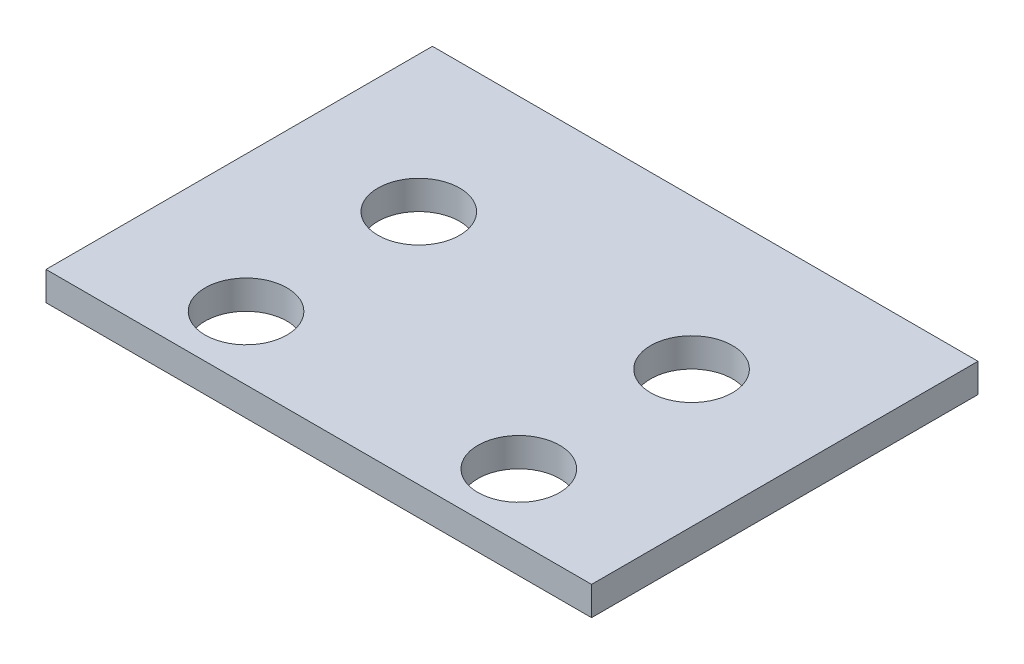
ISO-10303-21;
HEADER;
FILE_DESCRIPTION(('STEP AP214'),'2;1');
FILE_NAME('part.step','',(''),(''),'','','');
FILE_SCHEMA(('AUTOMOTIVE_DESIGN { 1 0 10303 214 1 1 1 1 }'));
ENDSEC;
DATA;
#1=APPLICATION_CONTEXT('core data for automotive mechanical design processes');
#2=APPLICATION_PROTOCOL_DEFINITION('international standard','automotive_design',2000,#1);
#3=PRODUCT_CONTEXT('',#1,'mechanical');
#4=PRODUCT('Part','Part','',(#3));
#5=PRODUCT_RELATED_PRODUCT_CATEGORY('part','',(#4));
#6=PRODUCT_DEFINITION_FORMATION('','',#4);
#7=PRODUCT_DEFINITION_CONTEXT('part definition',#1,'design');
#8=PRODUCT_DEFINITION('design','',#6,#7);
#9=PRODUCT_DEFINITION_SHAPE('','',#8);
#10=(LENGTH_UNIT() NAMED_UNIT(*) SI_UNIT(.MILLI.,.METRE.));
#11=(NAMED_UNIT(*) PLANE_ANGLE_UNIT() SI_UNIT($,.RADIAN.));
#12=(NAMED_UNIT(*) SI_UNIT($,.STERADIAN.) SOLID_ANGLE_UNIT());
#13=UNCERTAINTY_MEASURE_WITH_UNIT(LENGTH_MEASURE(1.E-05),#10,'distance_accuracy_value','');
#14=(GEOMETRIC_REPRESENTATION_CONTEXT(3) GLOBAL_UNCERTAINTY_ASSIGNED_CONTEXT((#13)) GLOBAL_UNIT_ASSIGNED_CONTEXT((#10,
#11,#12)) REPRESENTATION_CONTEXT('',''));
#15=CARTESIAN_POINT('',(0.,0.,0.));
#16=DIRECTION('',(0.,0.,1.));
#17=DIRECTION('',(1.,0.,0.));
#18=AXIS2_PLACEMENT_3D('',#15,#16,#17);
#19=CARTESIAN_POINT('',(30.,3.175,-21.25));
#20=DIRECTION('',(-1.,0.,0.));
#21=DIRECTION('',(0.,0.,1.));
#22=AXIS2_PLACEMENT_3D('',#19,#20,#21);
#23=PLANE('',#22);
#24=DIRECTION('',(0.,0.,-1.));
#25=VECTOR('',#24,1.);
#26=CARTESIAN_POINT('',(30.,0.,-21.25));
#27=LINE('',#26,#25);
#28=CARTESIAN_POINT('',(30.,0.,21.25));
#29=VERTEX_POINT('',#28);
#30=CARTESIAN_POINT('',(30.,0.,-21.25));
#31=VERTEX_POINT('',#30);
#32=EDGE_CURVE('E98',#29,#31,#27,.T.);
#33=ORIENTED_EDGE('',*,*,#32,.T.);
#34=DIRECTION('',(0.,-1.,0.));
#35=VECTOR('',#34,1.);
#36=CARTESIAN_POINT('',(30.,3.175,-21.25));
#37=LINE('',#36,#35);
#38=CARTESIAN_POINT('',(30.,3.175,-21.25));
#39=VERTEX_POINT('',#38);
#40=EDGE_CURVE('E11',#39,#31,#37,.T.);
#41=ORIENTED_EDGE('',*,*,#40,.F.);
#42=DIRECTION('',(0.,0.,-1.));
#43=VECTOR('',#42,1.);
#44=CARTESIAN_POINT('',(30.,3.175,-21.25));
#45=LINE('',#44,#43);
#46=CARTESIAN_POINT('',(30.,3.175,21.25));
#47=VERTEX_POINT('',#46);
#48=EDGE_CURVE('E85',#47,#39,#45,.T.);
#49=ORIENTED_EDGE('',*,*,#48,.F.);
#50=DIRECTION('',(0.,-1.,0.));
#51=VECTOR('',#50,1.);
#52=CARTESIAN_POINT('',(30.,3.175,21.25));
#53=LINE('',#52,#51);
#54=EDGE_CURVE('E94',#47,#29,#53,.T.);
#55=ORIENTED_EDGE('',*,*,#54,.T.);
#56=EDGE_LOOP('',(#33,#41,#49,#55));
#57=FACE_BOUND('',#56,.T.);
#58=ADVANCED_FACE('F32',(#57),#23,.F.);
#59=CARTESIAN_POINT('',(-30.,3.175,-21.25));
#60=DIRECTION('',(0.,0.,1.));
#61=DIRECTION('',(1.,0.,0.));
#62=AXIS2_PLACEMENT_3D('',#59,#60,#61);
#63=PLANE('',#62);
#64=DIRECTION('',(-1.,0.,0.));
#65=VECTOR('',#64,1.);
#66=CARTESIAN_POINT('',(-30.,0.,-21.25));
#67=LINE('',#66,#65);
#68=CARTESIAN_POINT('',(-30.,0.,-21.25));
#69=VERTEX_POINT('',#68);
#70=EDGE_CURVE('E89',#31,#69,#67,.T.);
#71=ORIENTED_EDGE('',*,*,#70,.T.);
#72=DIRECTION('',(0.,-1.,0.));
#73=VECTOR('',#72,1.);
#74=CARTESIAN_POINT('',(-30.,3.175,-21.25));
#75=LINE('',#74,#73);
#76=CARTESIAN_POINT('',(-30.,3.175,-21.25));
#77=VERTEX_POINT('',#76);
#78=EDGE_CURVE('E41',#77,#69,#75,.T.);
#79=ORIENTED_EDGE('',*,*,#78,.F.);
#80=DIRECTION('',(-1.,0.,0.));
#81=VECTOR('',#80,1.);
#82=CARTESIAN_POINT('',(-30.,3.175,-21.25));
#83=LINE('',#82,#81);
#84=EDGE_CURVE('E80',#39,#77,#83,.T.);
#85=ORIENTED_EDGE('',*,*,#84,.F.);
#86=ORIENTED_EDGE('',*,*,#40,.T.);
#87=EDGE_LOOP('',(#71,#79,#85,#86));
#88=FACE_BOUND('',#87,.T.);
#89=ADVANCED_FACE('F88',(#88),#63,.F.);
#90=CARTESIAN_POINT('',(-30.,3.175,-21.25));
#91=DIRECTION('',(1.,0.,0.));
#92=DIRECTION('',(0.,0.,-1.));
#93=AXIS2_PLACEMENT_3D('',#90,#91,#92);
#94=PLANE('',#93);
#95=DIRECTION('',(0.,0.,1.));
#96=VECTOR('',#95,1.);
#97=CARTESIAN_POINT('',(-30.,0.,-21.25));
#98=LINE('',#97,#96);
#99=CARTESIAN_POINT('',(-30.,0.,21.25));
#100=VERTEX_POINT('',#99);
#101=EDGE_CURVE('E67',#69,#100,#98,.T.);
#102=ORIENTED_EDGE('',*,*,#101,.T.);
#103=DIRECTION('',(0.,-1.,0.));
#104=VECTOR('',#103,1.);
#105=CARTESIAN_POINT('',(-30.,3.175,21.25));
#106=LINE('',#105,#104);
#107=CARTESIAN_POINT('',(-30.,3.175,21.25));
#108=VERTEX_POINT('',#107);
#109=EDGE_CURVE('E90',#108,#100,#106,.T.);
#110=ORIENTED_EDGE('',*,*,#109,.F.);
#111=DIRECTION('',(0.,0.,1.));
#112=VECTOR('',#111,1.);
#113=CARTESIAN_POINT('',(-30.,3.175,-21.25));
#114=LINE('',#113,#112);
#115=EDGE_CURVE('E83',#77,#108,#114,.T.);
#116=ORIENTED_EDGE('',*,*,#115,.F.);
#117=ORIENTED_EDGE('',*,*,#78,.T.);
#118=EDGE_LOOP('',(#102,#110,#116,#117));
#119=FACE_BOUND('',#118,.T.);
#120=ADVANCED_FACE('F92',(#119),#94,.F.);
#121=CARTESIAN_POINT('',(-30.,3.175,21.25));
#122=DIRECTION('',(0.,0.,-1.));
#123=DIRECTION('',(-1.,0.,0.));
#124=AXIS2_PLACEMENT_3D('',#121,#122,#123);
#125=PLANE('',#124);
#126=DIRECTION('',(1.,0.,0.));
#127=VECTOR('',#126,1.);
#128=CARTESIAN_POINT('',(-30.,0.,21.25));
#129=LINE('',#128,#127);
#130=EDGE_CURVE('E73',#100,#29,#129,.T.);
#131=ORIENTED_EDGE('',*,*,#130,.T.);
#132=ORIENTED_EDGE('',*,*,#54,.F.);
#133=DIRECTION('',(1.,0.,0.));
#134=VECTOR('',#133,1.);
#135=CARTESIAN_POINT('',(-30.,3.175,21.25));
#136=LINE('',#135,#134);
#137=EDGE_CURVE('E50',#108,#47,#136,.T.);
#138=ORIENTED_EDGE('',*,*,#137,.F.);
#139=ORIENTED_EDGE('',*,*,#109,.T.);
#140=EDGE_LOOP('',(#131,#132,#138,#139));
#141=FACE_BOUND('',#140,.T.);
#142=ADVANCED_FACE('F155',(#141),#125,.F.);
#143=CARTESIAN_POINT('',(30.,3.175,21.25));
#144=DIRECTION('',(0.,1.,0.));
#145=DIRECTION('',(0.,0.,1.));
#146=AXIS2_PLACEMENT_3D('',#143,#144,#145);
#147=PLANE('',#146);
#148=CARTESIAN_POINT('',(15.,3.175,-4.75000000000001));
#149=DIRECTION('',(0.,1.,0.));
#150=DIRECTION('',(0.,0.,1.));
#151=AXIS2_PLACEMENT_3D('',#148,#149,#150);
#152=CIRCLE('',#151,4.49999999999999);
#153=CARTESIAN_POINT('',(15.,3.175,-0.250000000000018));
#154=VERTEX_POINT('',#153);
#155=EDGE_CURVE('E123',#154,#154,#152,.T.);
#156=ORIENTED_EDGE('',*,*,#155,.F.);
#157=EDGE_LOOP('',(#156));
#158=FACE_BOUND('',#157,.T.);
#159=CARTESIAN_POINT('',(-15.,3.175,-4.75000000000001));
#160=DIRECTION('',(0.,1.,0.));
#161=DIRECTION('',(0.,0.,1.));
#162=AXIS2_PLACEMENT_3D('',#159,#160,#161);
#163=CIRCLE('',#162,4.49999999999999);
#164=CARTESIAN_POINT('',(-15.,3.175,-0.250000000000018));
#165=VERTEX_POINT('',#164);
#166=EDGE_CURVE('E113',#165,#165,#163,.T.);
#167=ORIENTED_EDGE('',*,*,#166,.F.);
#168=EDGE_LOOP('',(#167));
#169=FACE_BOUND('',#168,.T.);
#170=CARTESIAN_POINT('',(15.,3.175,14.25));
#171=DIRECTION('',(0.,1.,0.));
#172=DIRECTION('',(0.,0.,1.));
#173=AXIS2_PLACEMENT_3D('',#170,#171,#172);
#174=CIRCLE('',#173,4.49999999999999);
#175=CARTESIAN_POINT('',(15.,3.175,18.75));
#176=VERTEX_POINT('',#175);
#177=EDGE_CURVE('E110',#176,#176,#174,.T.);
#178=ORIENTED_EDGE('',*,*,#177,.F.);
#179=EDGE_LOOP('',(#178));
#180=FACE_BOUND('',#179,.T.);
#181=CARTESIAN_POINT('',(-15.,3.175,14.25));
#182=DIRECTION('',(0.,1.,0.));
#183=DIRECTION('',(0.,0.,1.));
#184=AXIS2_PLACEMENT_3D('',#181,#182,#183);
#185=CIRCLE('',#184,4.49999999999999);
#186=CARTESIAN_POINT('',(-15.,3.175,18.75));
#187=VERTEX_POINT('',#186);
#188=EDGE_CURVE('E109',#187,#187,#185,.T.);
#189=ORIENTED_EDGE('',*,*,#188,.F.);
#190=EDGE_LOOP('',(#189));
#191=FACE_BOUND('',#190,.T.);
#192=ORIENTED_EDGE('',*,*,#48,.T.);
#193=ORIENTED_EDGE('',*,*,#84,.T.);
#194=ORIENTED_EDGE('',*,*,#115,.T.);
#195=ORIENTED_EDGE('',*,*,#137,.T.);
#196=EDGE_LOOP('',(#192,#193,#194,#195));
#197=FACE_BOUND('',#196,.T.);
#198=ADVANCED_FACE('F81',(#158,#169,#180,#191,#197),#147,.T.);
#199=CARTESIAN_POINT('',(30.,0.,21.25));
#200=DIRECTION('',(0.,1.,0.));
#201=DIRECTION('',(0.,0.,1.));
#202=AXIS2_PLACEMENT_3D('',#199,#200,#201);
#203=PLANE('',#202);
#204=CARTESIAN_POINT('',(15.,0.,-4.75000000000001));
#205=DIRECTION('',(0.,1.,0.));
#206=DIRECTION('',(0.,0.,1.));
#207=AXIS2_PLACEMENT_3D('',#204,#205,#206);
#208=CIRCLE('',#207,4.49999999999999);
#209=CARTESIAN_POINT('',(15.,0.,-0.250000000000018));
#210=VERTEX_POINT('',#209);
#211=EDGE_CURVE('E35',#210,#210,#208,.T.);
#212=ORIENTED_EDGE('',*,*,#211,.T.);
#213=EDGE_LOOP('',(#212));
#214=FACE_BOUND('',#213,.T.);
#215=CARTESIAN_POINT('',(-15.,0.,-4.75000000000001));
#216=DIRECTION('',(0.,1.,0.));
#217=DIRECTION('',(0.,0.,1.));
#218=AXIS2_PLACEMENT_3D('',#215,#216,#217);
#219=CIRCLE('',#218,4.49999999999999);
#220=CARTESIAN_POINT('',(-15.,0.,-0.250000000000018));
#221=VERTEX_POINT('',#220);
#222=EDGE_CURVE('E111',#221,#221,#219,.T.);
#223=ORIENTED_EDGE('',*,*,#222,.T.);
#224=EDGE_LOOP('',(#223));
#225=FACE_BOUND('',#224,.T.);
#226=CARTESIAN_POINT('',(15.,0.,14.25));
#227=DIRECTION('',(0.,1.,0.));
#228=DIRECTION('',(0.,0.,1.));
#229=AXIS2_PLACEMENT_3D('',#226,#227,#228);
#230=CIRCLE('',#229,4.49999999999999);
#231=CARTESIAN_POINT('',(15.,0.,18.75));
#232=VERTEX_POINT('',#231);
#233=EDGE_CURVE('E107',#232,#232,#230,.T.);
#234=ORIENTED_EDGE('',*,*,#233,.T.);
#235=EDGE_LOOP('',(#234));
#236=FACE_BOUND('',#235,.T.);
#237=CARTESIAN_POINT('',(-15.,0.,14.25));
#238=DIRECTION('',(0.,1.,0.));
#239=DIRECTION('',(0.,0.,1.));
#240=AXIS2_PLACEMENT_3D('',#237,#238,#239);
#241=CIRCLE('',#240,4.49999999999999);
#242=CARTESIAN_POINT('',(-15.,0.,18.75));
#243=VERTEX_POINT('',#242);
#244=EDGE_CURVE('E101',#243,#243,#241,.T.);
#245=ORIENTED_EDGE('',*,*,#244,.T.);
#246=EDGE_LOOP('',(#245));
#247=FACE_BOUND('',#246,.T.);
#248=ORIENTED_EDGE('',*,*,#32,.F.);
#249=ORIENTED_EDGE('',*,*,#130,.F.);
#250=ORIENTED_EDGE('',*,*,#101,.F.);
#251=ORIENTED_EDGE('',*,*,#70,.F.);
#252=EDGE_LOOP('',(#248,#249,#250,#251));
#253=FACE_BOUND('',#252,.T.);
#254=ADVANCED_FACE('F131',(#214,#225,#236,#247,#253),#203,.F.);
#255=CARTESIAN_POINT('',(-15.,3.175,14.25));
#256=DIRECTION('',(0.,1.,0.));
#257=DIRECTION('',(0.,0.,1.));
#258=AXIS2_PLACEMENT_3D('',#255,#256,#257);
#259=CYLINDRICAL_SURFACE('',#258,4.49999999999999);
#260=ORIENTED_EDGE('',*,*,#188,.T.);
#261=EDGE_LOOP('',(#260));
#262=FACE_BOUND('',#261,.T.);
#263=ORIENTED_EDGE('',*,*,#244,.F.);
#264=EDGE_LOOP('',(#263));
#265=FACE_BOUND('',#264,.T.);
#266=ADVANCED_FACE('F134',(#262,#265),#259,.F.);
#267=CARTESIAN_POINT('',(15.,3.175,14.25));
#268=DIRECTION('',(0.,1.,0.));
#269=DIRECTION('',(0.,0.,1.));
#270=AXIS2_PLACEMENT_3D('',#267,#268,#269);
#271=CYLINDRICAL_SURFACE('',#270,4.49999999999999);
#272=ORIENTED_EDGE('',*,*,#177,.T.);
#273=EDGE_LOOP('',(#272));
#274=FACE_BOUND('',#273,.T.);
#275=ORIENTED_EDGE('',*,*,#233,.F.);
#276=EDGE_LOOP('',(#275));
#277=FACE_BOUND('',#276,.T.);
#278=ADVANCED_FACE('F136',(#274,#277),#271,.F.);
#279=CARTESIAN_POINT('',(-15.,3.175,-4.75000000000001));
#280=DIRECTION('',(0.,1.,0.));
#281=DIRECTION('',(0.,0.,1.));
#282=AXIS2_PLACEMENT_3D('',#279,#280,#281);
#283=CYLINDRICAL_SURFACE('',#282,4.49999999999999);
#284=ORIENTED_EDGE('',*,*,#166,.T.);
#285=EDGE_LOOP('',(#284));
#286=FACE_BOUND('',#285,.T.);
#287=ORIENTED_EDGE('',*,*,#222,.F.);
#288=EDGE_LOOP('',(#287));
#289=FACE_BOUND('',#288,.T.);
#290=ADVANCED_FACE('F143',(#286,#289),#283,.F.);
#291=CARTESIAN_POINT('',(15.,3.175,-4.75000000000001));
#292=DIRECTION('',(0.,1.,0.));
#293=DIRECTION('',(0.,0.,1.));
#294=AXIS2_PLACEMENT_3D('',#291,#292,#293);
#295=CYLINDRICAL_SURFACE('',#294,4.49999999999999);
#296=ORIENTED_EDGE('',*,*,#155,.T.);
#297=EDGE_LOOP('',(#296));
#298=FACE_BOUND('',#297,.T.);
#299=ORIENTED_EDGE('',*,*,#211,.F.);
#300=EDGE_LOOP('',(#299));
#301=FACE_BOUND('',#300,.T.);
#302=ADVANCED_FACE('F209',(#298,#301),#295,.F.);
#303=CLOSED_SHELL('',(#58,#89,#120,#142,#198,#254,#266,#278,#290,#302));
#304=MANIFOLD_SOLID_BREP('B2',#303);
#305=ADVANCED_BREP_SHAPE_REPRESENTATION('',(#18,#304),#14);
#306=SHAPE_DEFINITION_REPRESENTATION(#9,#305);
ENDSEC;
END-ISO-10303-21;
